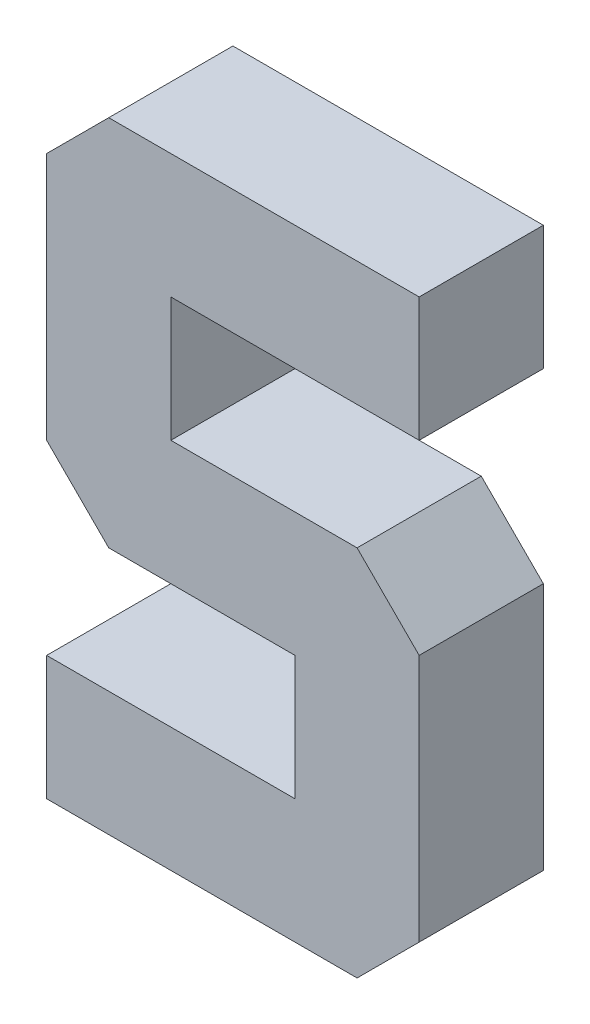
ISO-10303-21;
HEADER;
FILE_DESCRIPTION(('STEP AP214'),'2;1');
FILE_NAME('part.step','',(''),(''),'','','');
FILE_SCHEMA(('AUTOMOTIVE_DESIGN { 1 0 10303 214 1 1 1 1 }'));
ENDSEC;
DATA;
#1=APPLICATION_CONTEXT('core data for automotive mechanical design processes');
#2=APPLICATION_PROTOCOL_DEFINITION('international standard','automotive_design',2000,#1);
#3=PRODUCT_CONTEXT('',#1,'mechanical');
#4=PRODUCT('Part','Part','',(#3));
#5=PRODUCT_RELATED_PRODUCT_CATEGORY('part','',(#4));
#6=PRODUCT_DEFINITION_FORMATION('','',#4);
#7=PRODUCT_DEFINITION_CONTEXT('part definition',#1,'design');
#8=PRODUCT_DEFINITION('design','',#6,#7);
#9=PRODUCT_DEFINITION_SHAPE('','',#8);
#10=(LENGTH_UNIT() NAMED_UNIT(*) SI_UNIT(.MILLI.,.METRE.));
#11=(NAMED_UNIT(*) PLANE_ANGLE_UNIT() SI_UNIT($,.RADIAN.));
#12=(NAMED_UNIT(*) SI_UNIT($,.STERADIAN.) SOLID_ANGLE_UNIT());
#13=UNCERTAINTY_MEASURE_WITH_UNIT(LENGTH_MEASURE(1.E-05),#10,'distance_accuracy_value','');
#14=(GEOMETRIC_REPRESENTATION_CONTEXT(3) GLOBAL_UNCERTAINTY_ASSIGNED_CONTEXT((#13)) GLOBAL_UNIT_ASSIGNED_CONTEXT((#10,
#11,#12)) REPRESENTATION_CONTEXT('',''));
#15=CARTESIAN_POINT('',(0.,0.,0.));
#16=DIRECTION('',(0.,0.,1.));
#17=DIRECTION('',(1.,0.,0.));
#18=AXIS2_PLACEMENT_3D('',#15,#16,#17);
#19=CARTESIAN_POINT('',(0.,0.,10.));
#20=DIRECTION('',(1.,0.,0.));
#21=DIRECTION('',(0.,1.,0.));
#22=AXIS2_PLACEMENT_3D('',#19,#20,#21);
#23=PLANE('',#22);
#24=DIRECTION('',(0.,-1.,0.));
#25=VECTOR('',#24,1.);
#26=CARTESIAN_POINT('',(0.,0.,0.));
#27=LINE('',#26,#25);
#28=CARTESIAN_POINT('',(0.,10.,0.));
#29=VERTEX_POINT('',#28);
#30=CARTESIAN_POINT('',(0.,0.,0.));
#31=VERTEX_POINT('',#30);
#32=EDGE_CURVE('E169',#29,#31,#27,.T.);
#33=ORIENTED_EDGE('',*,*,#32,.T.);
#34=DIRECTION('',(0.,0.,-1.));
#35=VECTOR('',#34,1.);
#36=CARTESIAN_POINT('',(0.,0.,10.));
#37=LINE('',#36,#35);
#38=CARTESIAN_POINT('',(0.,0.,10.));
#39=VERTEX_POINT('',#38);
#40=EDGE_CURVE('E151',#39,#31,#37,.T.);
#41=ORIENTED_EDGE('',*,*,#40,.F.);
#42=DIRECTION('',(0.,-1.,0.));
#43=VECTOR('',#42,1.);
#44=CARTESIAN_POINT('',(0.,0.,10.));
#45=LINE('',#44,#43);
#46=CARTESIAN_POINT('',(0.,10.,10.));
#47=VERTEX_POINT('',#46);
#48=EDGE_CURVE('E157',#47,#39,#45,.T.);
#49=ORIENTED_EDGE('',*,*,#48,.F.);
#50=DIRECTION('',(0.,0.,-1.));
#51=VECTOR('',#50,1.);
#52=CARTESIAN_POINT('',(0.,10.,10.));
#53=LINE('',#52,#51);
#54=EDGE_CURVE('E230',#47,#29,#53,.T.);
#55=ORIENTED_EDGE('',*,*,#54,.T.);
#56=EDGE_LOOP('',(#33,#41,#49,#55));
#57=FACE_BOUND('',#56,.T.);
#58=ADVANCED_FACE('F33',(#57),#23,.F.);
#59=CARTESIAN_POINT('',(0.,0.,10.));
#60=DIRECTION('',(0.,1.,0.));
#61=DIRECTION('',(0.,0.,1.));
#62=AXIS2_PLACEMENT_3D('',#59,#60,#61);
#63=PLANE('',#62);
#64=DIRECTION('',(1.,0.,0.));
#65=VECTOR('',#64,1.);
#66=CARTESIAN_POINT('',(0.,0.,0.));
#67=LINE('',#66,#65);
#68=CARTESIAN_POINT('',(25.,0.,0.));
#69=VERTEX_POINT('',#68);
#70=EDGE_CURVE('E266',#31,#69,#67,.T.);
#71=ORIENTED_EDGE('',*,*,#70,.T.);
#72=DIRECTION('',(0.,0.,1.));
#73=VECTOR('',#72,1.);
#74=CARTESIAN_POINT('',(25.,0.,10.));
#75=LINE('',#74,#73);
#76=CARTESIAN_POINT('',(25.,0.,10.));
#77=VERTEX_POINT('',#76);
#78=EDGE_CURVE('E154',#69,#77,#75,.T.);
#79=ORIENTED_EDGE('',*,*,#78,.T.);
#80=DIRECTION('',(1.,0.,0.));
#81=VECTOR('',#80,1.);
#82=CARTESIAN_POINT('',(0.,0.,10.));
#83=LINE('',#82,#81);
#84=EDGE_CURVE('E146',#39,#77,#83,.T.);
#85=ORIENTED_EDGE('',*,*,#84,.F.);
#86=ORIENTED_EDGE('',*,*,#40,.T.);
#87=EDGE_LOOP('',(#71,#79,#85,#86));
#88=FACE_BOUND('',#87,.T.);
#89=ADVANCED_FACE('F149',(#88),#63,.F.);
#90=CARTESIAN_POINT('',(30.,0.,10.));
#91=DIRECTION('',(-1.,0.,0.));
#92=DIRECTION('',(0.,0.,1.));
#93=AXIS2_PLACEMENT_3D('',#90,#91,#92);
#94=PLANE('',#93);
#95=DIRECTION('',(0.,1.,0.));
#96=VECTOR('',#95,1.);
#97=CARTESIAN_POINT('',(30.,0.,10.));
#98=LINE('',#97,#96);
#99=CARTESIAN_POINT('',(30.,5.,10.));
#100=VERTEX_POINT('',#99);
#101=CARTESIAN_POINT('',(30.,25.,10.));
#102=VERTEX_POINT('',#101);
#103=EDGE_CURVE('E156',#100,#102,#98,.T.);
#104=ORIENTED_EDGE('',*,*,#103,.F.);
#105=DIRECTION('',(0.,0.,-1.));
#106=VECTOR('',#105,1.);
#107=CARTESIAN_POINT('',(30.,5.,10.));
#108=LINE('',#107,#106);
#109=CARTESIAN_POINT('',(30.,5.,0.));
#110=VERTEX_POINT('',#109);
#111=EDGE_CURVE('E173',#100,#110,#108,.T.);
#112=ORIENTED_EDGE('',*,*,#111,.T.);
#113=DIRECTION('',(0.,1.,0.));
#114=VECTOR('',#113,1.);
#115=CARTESIAN_POINT('',(30.,0.,0.));
#116=LINE('',#115,#114);
#117=CARTESIAN_POINT('',(30.,25.,0.));
#118=VERTEX_POINT('',#117);
#119=EDGE_CURVE('E263',#110,#118,#116,.T.);
#120=ORIENTED_EDGE('',*,*,#119,.T.);
#121=DIRECTION('',(0.,0.,1.));
#122=VECTOR('',#121,1.);
#123=CARTESIAN_POINT('',(30.,25.,10.));
#124=LINE('',#123,#122);
#125=EDGE_CURVE('E170',#118,#102,#124,.T.);
#126=ORIENTED_EDGE('',*,*,#125,.T.);
#127=EDGE_LOOP('',(#104,#112,#120,#126));
#128=FACE_BOUND('',#127,.T.);
#129=ADVANCED_FACE('F298',(#128),#94,.F.);
#130=CARTESIAN_POINT('',(30.,30.,10.));
#131=DIRECTION('',(0.,-1.,0.));
#132=DIRECTION('',(1.,0.,0.));
#133=AXIS2_PLACEMENT_3D('',#130,#131,#132);
#134=PLANE('',#133);
#135=DIRECTION('',(-1.,0.,0.));
#136=VECTOR('',#135,1.);
#137=CARTESIAN_POINT('',(30.,30.,10.));
#138=LINE('',#137,#136);
#139=CARTESIAN_POINT('',(25.,30.,10.));
#140=VERTEX_POINT('',#139);
#141=CARTESIAN_POINT('',(10.,30.,10.));
#142=VERTEX_POINT('',#141);
#143=EDGE_CURVE('E283',#140,#142,#138,.T.);
#144=ORIENTED_EDGE('',*,*,#143,.F.);
#145=DIRECTION('',(0.,0.,-1.));
#146=VECTOR('',#145,1.);
#147=CARTESIAN_POINT('',(25.,30.,10.));
#148=LINE('',#147,#146);
#149=CARTESIAN_POINT('',(25.,30.,0.));
#150=VERTEX_POINT('',#149);
#151=EDGE_CURVE('E198',#140,#150,#148,.T.);
#152=ORIENTED_EDGE('',*,*,#151,.T.);
#153=DIRECTION('',(-1.,0.,0.));
#154=VECTOR('',#153,1.);
#155=CARTESIAN_POINT('',(30.,30.,0.));
#156=LINE('',#155,#154);
#157=CARTESIAN_POINT('',(10.,30.,0.));
#158=VERTEX_POINT('',#157);
#159=EDGE_CURVE('E259',#150,#158,#156,.T.);
#160=ORIENTED_EDGE('',*,*,#159,.T.);
#161=DIRECTION('',(0.,0.,-1.));
#162=VECTOR('',#161,1.);
#163=CARTESIAN_POINT('',(10.,30.,10.));
#164=LINE('',#163,#162);
#165=EDGE_CURVE('E171',#142,#158,#164,.T.);
#166=ORIENTED_EDGE('',*,*,#165,.F.);
#167=EDGE_LOOP('',(#144,#152,#160,#166));
#168=FACE_BOUND('',#167,.T.);
#169=ADVANCED_FACE('F296',(#168),#134,.F.);
#170=CARTESIAN_POINT('',(10.,40.,10.));
#171=DIRECTION('',(-1.,0.,0.));
#172=DIRECTION('',(0.,-1.,0.));
#173=AXIS2_PLACEMENT_3D('',#170,#171,#172);
#174=PLANE('',#173);
#175=DIRECTION('',(0.,1.,0.));
#176=VECTOR('',#175,1.);
#177=CARTESIAN_POINT('',(10.,40.,0.));
#178=LINE('',#177,#176);
#179=CARTESIAN_POINT('',(10.,40.,0.));
#180=VERTEX_POINT('',#179);
#181=EDGE_CURVE('E257',#158,#180,#178,.T.);
#182=ORIENTED_EDGE('',*,*,#181,.T.);
#183=DIRECTION('',(0.,0.,-1.));
#184=VECTOR('',#183,1.);
#185=CARTESIAN_POINT('',(10.,40.,10.));
#186=LINE('',#185,#184);
#187=CARTESIAN_POINT('',(10.,40.,10.));
#188=VERTEX_POINT('',#187);
#189=EDGE_CURVE('E176',#188,#180,#186,.T.);
#190=ORIENTED_EDGE('',*,*,#189,.F.);
#191=DIRECTION('',(0.,1.,0.));
#192=VECTOR('',#191,1.);
#193=CARTESIAN_POINT('',(10.,40.,10.));
#194=LINE('',#193,#192);
#195=EDGE_CURVE('E281',#142,#188,#194,.T.);
#196=ORIENTED_EDGE('',*,*,#195,.F.);
#197=ORIENTED_EDGE('',*,*,#165,.T.);
#198=EDGE_LOOP('',(#182,#190,#196,#197));
#199=FACE_BOUND('',#198,.T.);
#200=ADVANCED_FACE('F357',(#199),#174,.F.);
#201=CARTESIAN_POINT('',(30.,40.,10.));
#202=DIRECTION('',(0.,1.,0.));
#203=DIRECTION('',(-1.,0.,0.));
#204=AXIS2_PLACEMENT_3D('',#201,#202,#203);
#205=PLANE('',#204);
#206=DIRECTION('',(1.,0.,0.));
#207=VECTOR('',#206,1.);
#208=CARTESIAN_POINT('',(30.,40.,0.));
#209=LINE('',#208,#207);
#210=CARTESIAN_POINT('',(30.,40.,0.));
#211=VERTEX_POINT('',#210);
#212=EDGE_CURVE('E250',#180,#211,#209,.T.);
#213=ORIENTED_EDGE('',*,*,#212,.T.);
#214=DIRECTION('',(0.,0.,-1.));
#215=VECTOR('',#214,1.);
#216=CARTESIAN_POINT('',(30.,40.,10.));
#217=LINE('',#216,#215);
#218=CARTESIAN_POINT('',(30.,40.,10.));
#219=VERTEX_POINT('',#218);
#220=EDGE_CURVE('E241',#219,#211,#217,.T.);
#221=ORIENTED_EDGE('',*,*,#220,.F.);
#222=DIRECTION('',(1.,0.,0.));
#223=VECTOR('',#222,1.);
#224=CARTESIAN_POINT('',(30.,40.,10.));
#225=LINE('',#224,#223);
#226=EDGE_CURVE('E251',#188,#219,#225,.T.);
#227=ORIENTED_EDGE('',*,*,#226,.F.);
#228=ORIENTED_EDGE('',*,*,#189,.T.);
#229=EDGE_LOOP('',(#213,#221,#227,#228));
#230=FACE_BOUND('',#229,.T.);
#231=ADVANCED_FACE('F248',(#230),#205,.F.);
#232=CARTESIAN_POINT('',(30.,40.,10.));
#233=DIRECTION('',(-1.,0.,0.));
#234=DIRECTION('',(0.,0.,1.));
#235=AXIS2_PLACEMENT_3D('',#232,#233,#234);
#236=PLANE('',#235);
#237=DIRECTION('',(0.,1.,0.));
#238=VECTOR('',#237,1.);
#239=CARTESIAN_POINT('',(30.,40.,0.));
#240=LINE('',#239,#238);
#241=CARTESIAN_POINT('',(30.,50.,0.));
#242=VERTEX_POINT('',#241);
#243=EDGE_CURVE('E224',#211,#242,#240,.T.);
#244=ORIENTED_EDGE('',*,*,#243,.T.);
#245=DIRECTION('',(0.,0.,-1.));
#246=VECTOR('',#245,1.);
#247=CARTESIAN_POINT('',(30.,50.,10.));
#248=LINE('',#247,#246);
#249=CARTESIAN_POINT('',(30.,50.,10.));
#250=VERTEX_POINT('',#249);
#251=EDGE_CURVE('E238',#250,#242,#248,.T.);
#252=ORIENTED_EDGE('',*,*,#251,.F.);
#253=DIRECTION('',(0.,1.,0.));
#254=VECTOR('',#253,1.);
#255=CARTESIAN_POINT('',(30.,40.,10.));
#256=LINE('',#255,#254);
#257=EDGE_CURVE('E278',#219,#250,#256,.T.);
#258=ORIENTED_EDGE('',*,*,#257,.F.);
#259=ORIENTED_EDGE('',*,*,#220,.T.);
#260=EDGE_LOOP('',(#244,#252,#258,#259));
#261=FACE_BOUND('',#260,.T.);
#262=ADVANCED_FACE('F350',(#261),#236,.F.);
#263=CARTESIAN_POINT('',(0.,50.,10.));
#264=DIRECTION('',(0.,-1.,0.));
#265=DIRECTION('',(0.,0.,-1.));
#266=AXIS2_PLACEMENT_3D('',#263,#264,#265);
#267=PLANE('',#266);
#268=DIRECTION('',(-1.,0.,0.));
#269=VECTOR('',#268,1.);
#270=CARTESIAN_POINT('',(0.,50.,0.));
#271=LINE('',#270,#269);
#272=CARTESIAN_POINT('',(5.00000000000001,50.,0.));
#273=VERTEX_POINT('',#272);
#274=EDGE_CURVE('E220',#242,#273,#271,.T.);
#275=ORIENTED_EDGE('',*,*,#274,.T.);
#276=DIRECTION('',(0.,0.,1.));
#277=VECTOR('',#276,1.);
#278=CARTESIAN_POINT('',(5.00000000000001,50.,10.));
#279=LINE('',#278,#277);
#280=CARTESIAN_POINT('',(5.00000000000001,50.,10.));
#281=VERTEX_POINT('',#280);
#282=EDGE_CURVE('E11',#273,#281,#279,.T.);
#283=ORIENTED_EDGE('',*,*,#282,.T.);
#284=DIRECTION('',(-1.,0.,0.));
#285=VECTOR('',#284,1.);
#286=CARTESIAN_POINT('',(0.,50.,10.));
#287=LINE('',#286,#285);
#288=EDGE_CURVE('E275',#250,#281,#287,.T.);
#289=ORIENTED_EDGE('',*,*,#288,.F.);
#290=ORIENTED_EDGE('',*,*,#251,.T.);
#291=EDGE_LOOP('',(#275,#283,#289,#290));
#292=FACE_BOUND('',#291,.T.);
#293=ADVANCED_FACE('F347',(#292),#267,.F.);
#294=CARTESIAN_POINT('',(0.,20.,10.));
#295=DIRECTION('',(1.,0.,0.));
#296=DIRECTION('',(0.,1.,0.));
#297=AXIS2_PLACEMENT_3D('',#294,#295,#296);
#298=PLANE('',#297);
#299=DIRECTION('',(0.,-1.,0.));
#300=VECTOR('',#299,1.);
#301=CARTESIAN_POINT('',(0.,20.,0.));
#302=LINE('',#301,#300);
#303=CARTESIAN_POINT('',(0.,45.,0.));
#304=VERTEX_POINT('',#303);
#305=CARTESIAN_POINT('',(0.,25.,0.));
#306=VERTEX_POINT('',#305);
#307=EDGE_CURVE('E209',#304,#306,#302,.T.);
#308=ORIENTED_EDGE('',*,*,#307,.T.);
#309=DIRECTION('',(0.,0.,1.));
#310=VECTOR('',#309,1.);
#311=CARTESIAN_POINT('',(0.,25.,10.));
#312=LINE('',#311,#310);
#313=CARTESIAN_POINT('',(0.,25.,10.));
#314=VERTEX_POINT('',#313);
#315=EDGE_CURVE('E41',#306,#314,#312,.T.);
#316=ORIENTED_EDGE('',*,*,#315,.T.);
#317=DIRECTION('',(0.,-1.,0.));
#318=VECTOR('',#317,1.);
#319=CARTESIAN_POINT('',(0.,20.,10.));
#320=LINE('',#319,#318);
#321=CARTESIAN_POINT('',(0.,45.,10.));
#322=VERTEX_POINT('',#321);
#323=EDGE_CURVE('E210',#322,#314,#320,.T.);
#324=ORIENTED_EDGE('',*,*,#323,.F.);
#325=DIRECTION('',(0.,0.,-1.));
#326=VECTOR('',#325,1.);
#327=CARTESIAN_POINT('',(0.,45.,10.));
#328=LINE('',#327,#326);
#329=EDGE_CURVE('E204',#322,#304,#328,.T.);
#330=ORIENTED_EDGE('',*,*,#329,.T.);
#331=EDGE_LOOP('',(#308,#316,#324,#330));
#332=FACE_BOUND('',#331,.T.);
#333=ADVANCED_FACE('F208',(#332),#298,.F.);
#334=CARTESIAN_POINT('',(0.,20.,10.));
#335=DIRECTION('',(0.,1.,0.));
#336=DIRECTION('',(0.,0.,1.));
#337=AXIS2_PLACEMENT_3D('',#334,#335,#336);
#338=PLANE('',#337);
#339=DIRECTION('',(1.,0.,0.));
#340=VECTOR('',#339,1.);
#341=CARTESIAN_POINT('',(0.,20.,10.));
#342=LINE('',#341,#340);
#343=CARTESIAN_POINT('',(5.,20.,10.));
#344=VERTEX_POINT('',#343);
#345=CARTESIAN_POINT('',(20.,20.,10.));
#346=VERTEX_POINT('',#345);
#347=EDGE_CURVE('E272',#344,#346,#342,.T.);
#348=ORIENTED_EDGE('',*,*,#347,.F.);
#349=DIRECTION('',(0.,0.,-1.));
#350=VECTOR('',#349,1.);
#351=CARTESIAN_POINT('',(5.,20.,10.));
#352=LINE('',#351,#350);
#353=CARTESIAN_POINT('',(5.,20.,0.));
#354=VERTEX_POINT('',#353);
#355=EDGE_CURVE('E201',#344,#354,#352,.T.);
#356=ORIENTED_EDGE('',*,*,#355,.T.);
#357=DIRECTION('',(1.,0.,0.));
#358=VECTOR('',#357,1.);
#359=CARTESIAN_POINT('',(0.,20.,0.));
#360=LINE('',#359,#358);
#361=CARTESIAN_POINT('',(20.,20.,0.));
#362=VERTEX_POINT('',#361);
#363=EDGE_CURVE('E219',#354,#362,#360,.T.);
#364=ORIENTED_EDGE('',*,*,#363,.T.);
#365=DIRECTION('',(0.,0.,-1.));
#366=VECTOR('',#365,1.);
#367=CARTESIAN_POINT('',(20.,20.,10.));
#368=LINE('',#367,#366);
#369=EDGE_CURVE('E235',#346,#362,#368,.T.);
#370=ORIENTED_EDGE('',*,*,#369,.F.);
#371=EDGE_LOOP('',(#348,#356,#364,#370));
#372=FACE_BOUND('',#371,.T.);
#373=ADVANCED_FACE('F311',(#372),#338,.F.);
#374=CARTESIAN_POINT('',(20.,20.,10.));
#375=DIRECTION('',(1.,0.,0.));
#376=DIRECTION('',(0.,1.,0.));
#377=AXIS2_PLACEMENT_3D('',#374,#375,#376);
#378=PLANE('',#377);
#379=DIRECTION('',(0.,-1.,0.));
#380=VECTOR('',#379,1.);
#381=CARTESIAN_POINT('',(20.,20.,0.));
#382=LINE('',#381,#380);
#383=CARTESIAN_POINT('',(20.,10.,0.));
#384=VERTEX_POINT('',#383);
#385=EDGE_CURVE('E222',#362,#384,#382,.T.);
#386=ORIENTED_EDGE('',*,*,#385,.T.);
#387=DIRECTION('',(0.,0.,-1.));
#388=VECTOR('',#387,1.);
#389=CARTESIAN_POINT('',(20.,10.,10.));
#390=LINE('',#389,#388);
#391=CARTESIAN_POINT('',(20.,10.,10.));
#392=VERTEX_POINT('',#391);
#393=EDGE_CURVE('E232',#392,#384,#390,.T.);
#394=ORIENTED_EDGE('',*,*,#393,.F.);
#395=DIRECTION('',(0.,-1.,0.));
#396=VECTOR('',#395,1.);
#397=CARTESIAN_POINT('',(20.,20.,10.));
#398=LINE('',#397,#396);
#399=EDGE_CURVE('E270',#346,#392,#398,.T.);
#400=ORIENTED_EDGE('',*,*,#399,.F.);
#401=ORIENTED_EDGE('',*,*,#369,.T.);
#402=EDGE_LOOP('',(#386,#394,#400,#401));
#403=FACE_BOUND('',#402,.T.);
#404=ADVANCED_FACE('F308',(#403),#378,.F.);
#405=CARTESIAN_POINT('',(0.,10.,10.));
#406=DIRECTION('',(0.,-1.,0.));
#407=DIRECTION('',(0.,0.,-1.));
#408=AXIS2_PLACEMENT_3D('',#405,#406,#407);
#409=PLANE('',#408);
#410=DIRECTION('',(-1.,0.,0.));
#411=VECTOR('',#410,1.);
#412=CARTESIAN_POINT('',(0.,10.,0.));
#413=LINE('',#412,#411);
#414=EDGE_CURVE('E166',#384,#29,#413,.T.);
#415=ORIENTED_EDGE('',*,*,#414,.T.);
#416=ORIENTED_EDGE('',*,*,#54,.F.);
#417=DIRECTION('',(-1.,0.,0.));
#418=VECTOR('',#417,1.);
#419=CARTESIAN_POINT('',(0.,10.,10.));
#420=LINE('',#419,#418);
#421=EDGE_CURVE('E162',#392,#47,#420,.T.);
#422=ORIENTED_EDGE('',*,*,#421,.F.);
#423=ORIENTED_EDGE('',*,*,#393,.T.);
#424=EDGE_LOOP('',(#415,#416,#422,#423));
#425=FACE_BOUND('',#424,.T.);
#426=ADVANCED_FACE('F304',(#425),#409,.F.);
#427=CARTESIAN_POINT('',(0.,0.,10.));
#428=DIRECTION('',(0.,0.,-1.));
#429=DIRECTION('',(-1.,0.,0.));
#430=AXIS2_PLACEMENT_3D('',#427,#428,#429);
#431=PLANE('',#430);
#432=ORIENTED_EDGE('',*,*,#84,.T.);
#433=DIRECTION('',(-0.707106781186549,-0.707106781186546,0.));
#434=VECTOR('',#433,1.);
#435=CARTESIAN_POINT('',(30.,5.,10.));
#436=LINE('',#435,#434);
#437=EDGE_CURVE('E196',#77,#100,#436,.F.);
#438=ORIENTED_EDGE('',*,*,#437,.T.);
#439=ORIENTED_EDGE('',*,*,#103,.T.);
#440=DIRECTION('',(0.707106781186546,-0.707106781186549,0.));
#441=VECTOR('',#440,1.);
#442=CARTESIAN_POINT('',(25.,30.,10.));
#443=LINE('',#442,#441);
#444=EDGE_CURVE('E194',#102,#140,#443,.F.);
#445=ORIENTED_EDGE('',*,*,#444,.T.);
#446=ORIENTED_EDGE('',*,*,#143,.T.);
#447=ORIENTED_EDGE('',*,*,#195,.T.);
#448=ORIENTED_EDGE('',*,*,#226,.T.);
#449=ORIENTED_EDGE('',*,*,#257,.T.);
#450=ORIENTED_EDGE('',*,*,#288,.T.);
#451=DIRECTION('',(0.707106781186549,0.707106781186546,0.));
#452=VECTOR('',#451,1.);
#453=CARTESIAN_POINT('',(0.,45.,10.));
#454=LINE('',#453,#452);
#455=EDGE_CURVE('E191',#281,#322,#454,.F.);
#456=ORIENTED_EDGE('',*,*,#455,.T.);
#457=ORIENTED_EDGE('',*,*,#323,.T.);
#458=DIRECTION('',(-0.707106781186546,0.707106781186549,0.));
#459=VECTOR('',#458,1.);
#460=CARTESIAN_POINT('',(5.,20.,10.));
#461=LINE('',#460,#459);
#462=EDGE_CURVE('E48',#314,#344,#461,.F.);
#463=ORIENTED_EDGE('',*,*,#462,.T.);
#464=ORIENTED_EDGE('',*,*,#347,.T.);
#465=ORIENTED_EDGE('',*,*,#399,.T.);
#466=ORIENTED_EDGE('',*,*,#421,.T.);
#467=ORIENTED_EDGE('',*,*,#48,.T.);
#468=EDGE_LOOP('',(#432,#438,#439,#445,#446,#447,#448,#449,#450,#456,#457,#463,#464,#465,#466,#467));
#469=FACE_BOUND('',#468,.T.);
#470=ADVANCED_FACE('F160',(#469),#431,.F.);
#471=CARTESIAN_POINT('',(0.,0.,0.));
#472=DIRECTION('',(0.,0.,-1.));
#473=DIRECTION('',(-1.,0.,0.));
#474=AXIS2_PLACEMENT_3D('',#471,#472,#473);
#475=PLANE('',#474);
#476=ORIENTED_EDGE('',*,*,#119,.F.);
#477=DIRECTION('',(0.707106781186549,0.707106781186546,0.));
#478=VECTOR('',#477,1.);
#479=CARTESIAN_POINT('',(12.4999999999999,-12.5,0.));
#480=LINE('',#479,#478);
#481=EDGE_CURVE('E188',#110,#69,#480,.F.);
#482=ORIENTED_EDGE('',*,*,#481,.T.);
#483=ORIENTED_EDGE('',*,*,#70,.F.);
#484=ORIENTED_EDGE('',*,*,#32,.F.);
#485=ORIENTED_EDGE('',*,*,#414,.F.);
#486=ORIENTED_EDGE('',*,*,#385,.F.);
#487=ORIENTED_EDGE('',*,*,#363,.F.);
#488=DIRECTION('',(0.707106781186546,-0.707106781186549,0.));
#489=VECTOR('',#488,1.);
#490=CARTESIAN_POINT('',(12.5,12.5,0.));
#491=LINE('',#490,#489);
#492=EDGE_CURVE('E184',#354,#306,#491,.F.);
#493=ORIENTED_EDGE('',*,*,#492,.T.);
#494=ORIENTED_EDGE('',*,*,#307,.F.);
#495=DIRECTION('',(-0.707106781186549,-0.707106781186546,0.));
#496=VECTOR('',#495,1.);
#497=CARTESIAN_POINT('',(-22.5,22.5000000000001,0.));
#498=LINE('',#497,#496);
#499=EDGE_CURVE('E182',#304,#273,#498,.F.);
#500=ORIENTED_EDGE('',*,*,#499,.T.);
#501=ORIENTED_EDGE('',*,*,#274,.F.);
#502=ORIENTED_EDGE('',*,*,#243,.F.);
#503=ORIENTED_EDGE('',*,*,#212,.F.);
#504=ORIENTED_EDGE('',*,*,#181,.F.);
#505=ORIENTED_EDGE('',*,*,#159,.F.);
#506=DIRECTION('',(-0.707106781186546,0.707106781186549,0.));
#507=VECTOR('',#506,1.);
#508=CARTESIAN_POINT('',(27.5000000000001,27.4999999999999,0.));
#509=LINE('',#508,#507);
#510=EDGE_CURVE('E186',#150,#118,#509,.F.);
#511=ORIENTED_EDGE('',*,*,#510,.T.);
#512=EDGE_LOOP('',(#476,#482,#483,#484,#485,#486,#487,#493,#494,#500,#501,#502,#503,#504,#505,#511));
#513=FACE_BOUND('',#512,.T.);
#514=ADVANCED_FACE('F215',(#513),#475,.T.);
#515=CARTESIAN_POINT('',(30.,5.,10.));
#516=DIRECTION('',(-0.707106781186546,0.707106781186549,0.));
#517=DIRECTION('',(0.,0.,-1.));
#518=AXIS2_PLACEMENT_3D('',#515,#516,#517);
#519=PLANE('',#518);
#520=ORIENTED_EDGE('',*,*,#437,.F.);
#521=ORIENTED_EDGE('',*,*,#78,.F.);
#522=ORIENTED_EDGE('',*,*,#481,.F.);
#523=ORIENTED_EDGE('',*,*,#111,.F.);
#524=EDGE_LOOP('',(#520,#521,#522,#523));
#525=FACE_BOUND('',#524,.T.);
#526=ADVANCED_FACE('F300',(#525),#519,.F.);
#527=CARTESIAN_POINT('',(25.,30.,10.));
#528=DIRECTION('',(-0.707106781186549,-0.707106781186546,0.));
#529=DIRECTION('',(0.,0.,-1.));
#530=AXIS2_PLACEMENT_3D('',#527,#528,#529);
#531=PLANE('',#530);
#532=ORIENTED_EDGE('',*,*,#444,.F.);
#533=ORIENTED_EDGE('',*,*,#125,.F.);
#534=ORIENTED_EDGE('',*,*,#510,.F.);
#535=ORIENTED_EDGE('',*,*,#151,.F.);
#536=EDGE_LOOP('',(#532,#533,#534,#535));
#537=FACE_BOUND('',#536,.T.);
#538=ADVANCED_FACE('F294',(#537),#531,.F.);
#539=CARTESIAN_POINT('',(5.,20.,10.));
#540=DIRECTION('',(0.707106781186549,0.707106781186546,0.));
#541=DIRECTION('',(0.,0.,-1.));
#542=AXIS2_PLACEMENT_3D('',#539,#540,#541);
#543=PLANE('',#542);
#544=ORIENTED_EDGE('',*,*,#462,.F.);
#545=ORIENTED_EDGE('',*,*,#315,.F.);
#546=ORIENTED_EDGE('',*,*,#492,.F.);
#547=ORIENTED_EDGE('',*,*,#355,.F.);
#548=EDGE_LOOP('',(#544,#545,#546,#547));
#549=FACE_BOUND('',#548,.T.);
#550=ADVANCED_FACE('F314',(#549),#543,.F.);
#551=CARTESIAN_POINT('',(0.,45.,10.));
#552=DIRECTION('',(0.707106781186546,-0.707106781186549,0.));
#553=DIRECTION('',(0.,0.,-1.));
#554=AXIS2_PLACEMENT_3D('',#551,#552,#553);
#555=PLANE('',#554);
#556=ORIENTED_EDGE('',*,*,#455,.F.);
#557=ORIENTED_EDGE('',*,*,#282,.F.);
#558=ORIENTED_EDGE('',*,*,#499,.F.);
#559=ORIENTED_EDGE('',*,*,#329,.F.);
#560=EDGE_LOOP('',(#556,#557,#558,#559));
#561=FACE_BOUND('',#560,.T.);
#562=ADVANCED_FACE('F35',(#561),#555,.F.);
#563=CLOSED_SHELL('',(#58,#89,#129,#169,#200,#231,#262,#293,#333,#373,#404,#426,#470,#514,#526,
#538,#550,#562));
#564=MANIFOLD_SOLID_BREP('B2',#563);
#565=ADVANCED_BREP_SHAPE_REPRESENTATION('',(#18,#564),#14);
#566=SHAPE_DEFINITION_REPRESENTATION(#9,#565);
ENDSEC;
END-ISO-10303-21;
